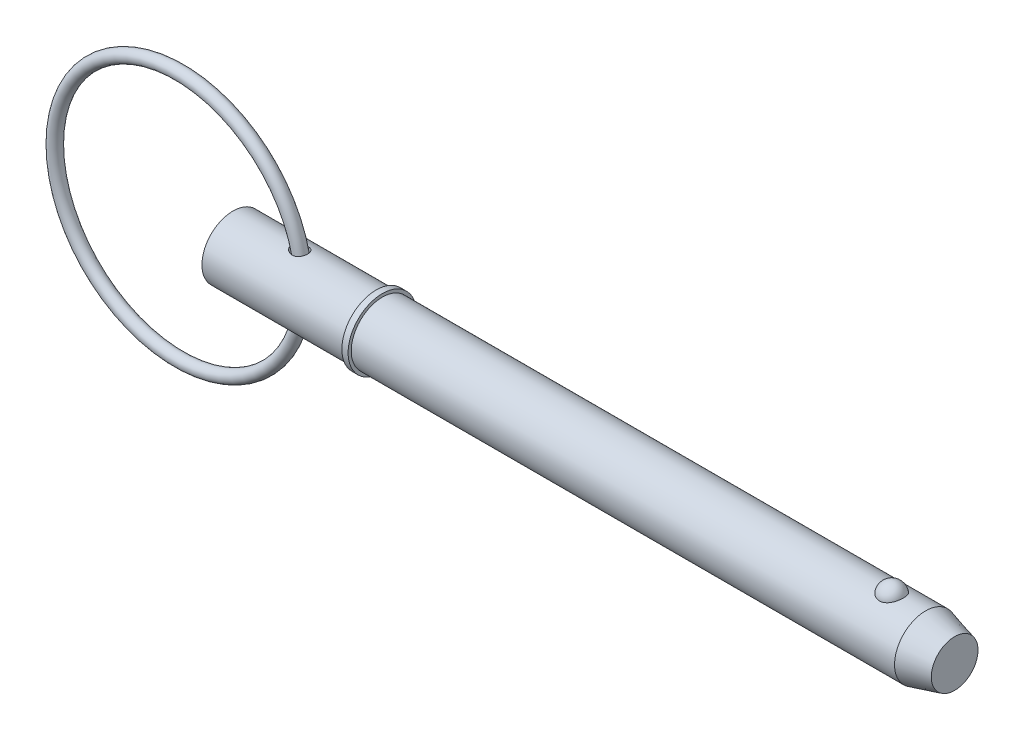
ISO-10303-21;
HEADER;
FILE_DESCRIPTION(('STEP AP214'),'2;1');
FILE_NAME('part.step','',(''),(''),'','','');
FILE_SCHEMA(('AUTOMOTIVE_DESIGN { 1 0 10303 214 1 1 1 1 }'));
ENDSEC;
DATA;
#1=APPLICATION_CONTEXT('core data for automotive mechanical design processes');
#2=APPLICATION_PROTOCOL_DEFINITION('international standard','automotive_design',2000,#1);
#3=PRODUCT_CONTEXT('',#1,'mechanical');
#4=PRODUCT('Part','Part','',(#3));
#5=PRODUCT_RELATED_PRODUCT_CATEGORY('part','',(#4));
#6=PRODUCT_DEFINITION_FORMATION('','',#4);
#7=PRODUCT_DEFINITION_CONTEXT('part definition',#1,'design');
#8=PRODUCT_DEFINITION('design','',#6,#7);
#9=PRODUCT_DEFINITION_SHAPE('','',#8);
#10=(LENGTH_UNIT() NAMED_UNIT(*) SI_UNIT(.MILLI.,.METRE.));
#11=(NAMED_UNIT(*) PLANE_ANGLE_UNIT() SI_UNIT($,.RADIAN.));
#12=(NAMED_UNIT(*) SI_UNIT($,.STERADIAN.) SOLID_ANGLE_UNIT());
#13=UNCERTAINTY_MEASURE_WITH_UNIT(LENGTH_MEASURE(1.E-05),#10,'distance_accuracy_value','');
#14=(GEOMETRIC_REPRESENTATION_CONTEXT(3) GLOBAL_UNCERTAINTY_ASSIGNED_CONTEXT((#13)) GLOBAL_UNIT_ASSIGNED_CONTEXT((#10,
#11,#12)) REPRESENTATION_CONTEXT('',''));
#15=CARTESIAN_POINT('',(0.,0.,0.));
#16=DIRECTION('',(0.,0.,1.));
#17=DIRECTION('',(1.,0.,0.));
#18=AXIS2_PLACEMENT_3D('',#15,#16,#17);
#19=CARTESIAN_POINT('',(-6.86864682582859,0.,0.));
#20=DIRECTION('',(0.,0.,1.));
#21=DIRECTION('',(1.,0.,0.));
#22=AXIS2_PLACEMENT_3D('',#19,#20,#21);
#23=TOROIDAL_SURFACE('',#22,15.875,0.794);
#24=CARTESIAN_POINT('',(9.80035317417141,0.,0.));
#25=VERTEX_POINT('',#24);
#26=VERTEX_LOOP('',#25);
#27=FACE_BOUND('',#26,.T.);
#28=ADVANCED_FACE('P0_F12',(#27),#23,.T.);
#29=CLOSED_SHELL('',(#28));
#30=MANIFOLD_SOLID_BREP('P0_B1',#29);
#31=CARTESIAN_POINT('',(0.,0.,0.));
#32=DIRECTION('',(1.,0.,0.));
#33=DIRECTION('',(0.,0.,-1.));
#34=AXIS2_PLACEMENT_3D('',#31,#32,#33);
#35=CYLINDRICAL_SURFACE('',#34,3.97);
#36=CARTESIAN_POINT('',(7.49679817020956,3.96502331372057,-0.198721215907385));
#37=CARTESIAN_POINT('',(7.50881508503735,3.96235594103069,-0.251916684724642));
#38=CARTESIAN_POINT('',(7.52561550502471,3.95866151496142,-0.304017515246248));
#39=CARTESIAN_POINT('',(7.56786984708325,3.9496659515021,-0.40447153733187));
#40=CARTESIAN_POINT('',(7.59333797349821,3.94436217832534,-0.452818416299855));
#41=CARTESIAN_POINT('',(7.65162192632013,3.93277091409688,-0.544364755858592));
#42=CARTESIAN_POINT('',(7.68440149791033,3.92648832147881,-0.587588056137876));
#43=CARTESIAN_POINT('',(7.75622109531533,3.91354812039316,-0.668369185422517));
#44=CARTESIAN_POINT('',(7.79526077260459,3.90689053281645,-0.705927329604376));
#45=CARTESIAN_POINT('',(7.88192852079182,3.8932854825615,-0.777603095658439));
#46=CARTESIAN_POINT('',(7.92999678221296,3.88635845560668,-0.811192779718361));
#47=CARTESIAN_POINT('',(8.03094744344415,3.87352417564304,-0.870420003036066));
#48=CARTESIAN_POINT('',(8.08383192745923,3.86761736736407,-0.896054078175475));
#49=CARTESIAN_POINT('',(8.19632733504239,3.85719062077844,-0.939958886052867));
#50=CARTESIAN_POINT('',(8.25615064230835,3.85277154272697,-0.957713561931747));
#51=CARTESIAN_POINT('',(8.37807849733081,3.84644428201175,-0.982821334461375));
#52=CARTESIAN_POINT('',(8.44018249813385,3.84453550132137,-0.990176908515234));
#53=CARTESIAN_POINT('',(8.56256649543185,3.84359535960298,-0.993820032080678));
#54=CARTESIAN_POINT('',(8.62283390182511,3.84446524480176,-0.990487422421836));
#55=CARTESIAN_POINT('',(8.74175397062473,3.84884648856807,-0.973323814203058));
#56=CARTESIAN_POINT('',(8.8004073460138,3.85235666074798,-0.959497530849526));
#57=CARTESIAN_POINT('',(8.91034168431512,3.86130428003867,-0.922798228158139));
#58=CARTESIAN_POINT('',(8.96185380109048,3.86659969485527,-0.900580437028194));
#59=CARTESIAN_POINT('',(9.06016940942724,3.87853590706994,-0.847697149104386));
#60=CARTESIAN_POINT('',(9.10697344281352,3.88517654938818,-0.817032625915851));
#61=CARTESIAN_POINT('',(9.19340982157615,3.89885483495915,-0.748999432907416));
#62=CARTESIAN_POINT('',(9.23319345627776,3.90587821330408,-0.711819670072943));
#63=CARTESIAN_POINT('',(9.30598310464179,3.91969783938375,-0.631295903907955));
#64=CARTESIAN_POINT('',(9.33898892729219,3.92649408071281,-0.587951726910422));
#65=CARTESIAN_POINT('',(9.39769437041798,3.939185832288,-0.495874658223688));
#66=CARTESIAN_POINT('',(9.42332322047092,3.94507238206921,-0.447095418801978));
#67=CARTESIAN_POINT('',(9.46625710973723,3.9552342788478,-0.345845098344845));
#68=CARTESIAN_POINT('',(9.48356178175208,3.95950955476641,-0.293373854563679));
#69=CARTESIAN_POINT('',(9.50956700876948,3.96602451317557,-0.185698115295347));
#70=CARTESIAN_POINT('',(9.51818595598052,3.96824487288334,-0.13047272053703));
#71=CARTESIAN_POINT('',(9.52633336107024,3.97034220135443,-0.0193113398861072));
#72=CARTESIAN_POINT('',(9.52586171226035,3.97021914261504,0.0366246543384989));
#73=CARTESIAN_POINT('',(9.51583327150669,3.9676413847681,0.147685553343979));
#74=CARTESIAN_POINT('',(9.50626624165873,3.96518405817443,0.202809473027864));
#75=CARTESIAN_POINT('',(9.47825604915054,3.95819854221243,0.310618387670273));
#76=CARTESIAN_POINT('',(9.45981267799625,3.95367030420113,0.36330332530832));
#77=CARTESIAN_POINT('',(9.41448405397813,3.94303435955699,0.464739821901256));
#78=CARTESIAN_POINT('',(9.38759833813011,3.93692656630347,0.51349116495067));
#79=CARTESIAN_POINT('',(9.32603556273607,3.92380455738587,0.605663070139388));
#80=CARTESIAN_POINT('',(9.29135869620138,3.91679036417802,0.649083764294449));
#81=CARTESIAN_POINT('',(9.21526329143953,3.90267522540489,0.729160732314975));
#82=CARTESIAN_POINT('',(9.17387556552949,3.89557480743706,0.765846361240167));
#83=CARTESIAN_POINT('',(9.08536362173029,3.88206315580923,0.831635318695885));
#84=CARTESIAN_POINT('',(9.03824022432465,3.8756518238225,0.860739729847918));
#85=CARTESIAN_POINT('',(8.94022154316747,3.86431915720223,0.910262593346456));
#86=CARTESIAN_POINT('',(8.88938101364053,3.85938013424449,0.930785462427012));
#87=CARTESIAN_POINT('',(8.78488780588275,3.85141510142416,0.96321476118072));
#88=CARTESIAN_POINT('',(8.73123520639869,3.84838903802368,0.975121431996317));
#89=CARTESIAN_POINT('',(8.62249427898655,3.84453017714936,0.990226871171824));
#90=CARTESIAN_POINT('',(8.56740225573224,3.84370373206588,0.993400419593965));
#91=CARTESIAN_POINT('',(8.45741104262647,3.8442816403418,0.991160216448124));
#92=CARTESIAN_POINT('',(8.40251189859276,3.84568649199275,0.98574454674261));
#93=CARTESIAN_POINT('',(8.29176880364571,3.85062289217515,0.966285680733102));
#94=CARTESIAN_POINT('',(8.23599684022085,3.85424894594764,0.951858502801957));
#95=CARTESIAN_POINT('',(8.12747212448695,3.86325492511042,0.91461785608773));
#96=CARTESIAN_POINT('',(8.0747205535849,3.86863553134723,0.891801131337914));
#97=CARTESIAN_POINT('',(7.97015235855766,3.88095261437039,0.836633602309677));
#98=CARTESIAN_POINT('',(7.91862083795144,3.88796764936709,0.803758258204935));
#99=CARTESIAN_POINT('',(7.82179253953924,3.90250904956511,0.729888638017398));
#100=CARTESIAN_POINT('',(7.77649765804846,3.91003556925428,0.688891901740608));
#101=CARTESIAN_POINT('',(7.69332536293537,3.92478114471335,0.599225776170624));
#102=CARTESIAN_POINT('',(7.6555122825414,3.93199714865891,0.550495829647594));
#103=CARTESIAN_POINT('',(7.5894819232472,3.94512912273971,0.446741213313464));
#104=CARTESIAN_POINT('',(7.56125849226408,3.95104592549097,0.391720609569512));
#105=CARTESIAN_POINT('',(7.51806227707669,3.9603062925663,0.282172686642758));
#106=CARTESIAN_POINT('',(7.50213211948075,3.96383230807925,0.228039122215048));
#107=CARTESIAN_POINT('',(7.48057398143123,3.96863642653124,0.117706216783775));
#108=CARTESIAN_POINT('',(7.47492746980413,3.96991857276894,0.0615107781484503));
#109=CARTESIAN_POINT('',(7.47437932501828,3.97004395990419,-0.0289758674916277));
#110=CARTESIAN_POINT('',(7.47615129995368,3.96964216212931,-0.0632805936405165));
#111=CARTESIAN_POINT('',(7.48358566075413,3.96796978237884,-0.131441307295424));
#112=CARTESIAN_POINT('',(7.48924767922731,3.96669928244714,-0.165297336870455));
#113=CARTESIAN_POINT('',(7.49679817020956,3.96502331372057,-0.198721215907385));
#114=B_SPLINE_CURVE_WITH_KNOTS('',3,(#36,#37,#38,#39,#40,#41,#42,#43,#44,#45,#46,#47,#48,#49,
#50,#51,#52,#53,#54,#55,#56,#57,#58,#59,#60,#61,#62,#63,#64,#65,#66,#67,#68,#69,#70,#71,#72,#73,
#74,#75,#76,#77,#78,#79,#80,#81,#82,#83,#84,#85,#86,#87,#88,#89,#90,#91,#92,#93,#94,#95,#96,#97,
#98,#99,#100,#101,#102,#103,#104,#105,#106,#107,#108,#109,#110,#111,#112,#113),.UNSPECIFIED.,
.T.,.F.,(4,2,2,2,2,2,2,2,2,2,2,2,2,2,2,2,2,2,2,2,2,2,2,2,2,2,2,2,2,2,2,2,2,2,2,2,2,2,4),(0.,
0.163661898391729,0.327593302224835,0.490729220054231,0.653856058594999,0.830244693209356,
1.00671002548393,1.1934572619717,1.38016000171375,1.56030212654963,1.74036335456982,
1.90857505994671,2.07676738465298,2.24071128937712,2.40465981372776,2.57013239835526,
2.73561228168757,2.90263284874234,3.06965537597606,3.23686612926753,3.40408081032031,
3.5713046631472,3.73852437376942,3.90499698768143,4.07144581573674,4.2358058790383,
4.40016134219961,4.56499094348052,4.72985735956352,4.90227873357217,5.0747670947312,
5.25849939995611,5.44228744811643,5.62759301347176,5.81277947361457,5.98144776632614,
6.14981181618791,6.25265388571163,6.35548624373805),.UNSPECIFIED.);
#115=CARTESIAN_POINT('',(7.49679817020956,3.96502331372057,-0.198721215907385));
#116=VERTEX_POINT('',#115);
#117=EDGE_CURVE('P1_E42',#116,#116,#114,.T.);
#118=ORIENTED_EDGE('',*,*,#117,.T.);
#119=EDGE_LOOP('',(#118));
#120=FACE_BOUND('',#119,.T.);
#121=CARTESIAN_POINT('',(0.,0.,0.));
#122=DIRECTION('',(1.,0.,0.));
#123=DIRECTION('',(0.,0.,-1.));
#124=AXIS2_PLACEMENT_3D('',#121,#122,#123);
#125=CIRCLE('',#124,3.97);
#126=CARTESIAN_POINT('',(0.,0.,-3.97));
#127=VERTEX_POINT('',#126);
#128=EDGE_CURVE('P1_E9',#127,#127,#125,.T.);
#129=ORIENTED_EDGE('',*,*,#128,.T.);
#130=EDGE_LOOP('',(#129));
#131=FACE_BOUND('',#130,.T.);
#132=CARTESIAN_POINT('',(18.256,0.,0.));
#133=DIRECTION('',(1.,0.,0.));
#134=DIRECTION('',(0.,0.,-1.));
#135=AXIS2_PLACEMENT_3D('',#132,#133,#134);
#136=CIRCLE('',#135,3.97);
#137=CARTESIAN_POINT('',(18.256,0.,-3.97));
#138=VERTEX_POINT('',#137);
#139=EDGE_CURVE('P1_E25',#138,#138,#136,.T.);
#140=ORIENTED_EDGE('',*,*,#139,.F.);
#141=EDGE_LOOP('',(#140));
#142=FACE_BOUND('',#141,.T.);
#143=CARTESIAN_POINT('',(7.49679817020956,-3.96502331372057,-0.198721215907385));
#144=CARTESIAN_POINT('',(7.48580986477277,-3.96746179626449,-0.150065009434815));
#145=CARTESIAN_POINT('',(7.47881617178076,-3.96904213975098,-0.100459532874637));
#146=CARTESIAN_POINT('',(7.47318383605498,-3.97031279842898,-0.000748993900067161));
#147=CARTESIAN_POINT('',(7.47454464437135,-3.97000323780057,0.049356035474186));
#148=CARTESIAN_POINT('',(7.48554252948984,-3.9675299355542,0.148550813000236));
#149=CARTESIAN_POINT('',(7.49517270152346,-3.9653677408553,0.197641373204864));
#150=CARTESIAN_POINT('',(7.5222068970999,-3.95942609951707,0.293523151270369));
#151=CARTESIAN_POINT('',(7.53961293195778,-3.9556462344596,0.340313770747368));
#152=CARTESIAN_POINT('',(7.58186218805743,-3.946757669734,0.431446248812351));
#153=CARTESIAN_POINT('',(7.6068526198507,-3.94162295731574,0.475716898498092));
#154=CARTESIAN_POINT('',(7.66318857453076,-3.93055115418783,0.559886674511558));
#155=CARTESIAN_POINT('',(7.69453617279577,-3.92461380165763,0.599784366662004));
#156=CARTESIAN_POINT('',(7.76618955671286,-3.91181958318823,0.678467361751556));
#157=CARTESIAN_POINT('',(7.80708710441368,-3.90493119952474,0.716708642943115));
#158=CARTESIAN_POINT('',(7.89431870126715,-3.89148185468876,0.786469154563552));
#159=CARTESIAN_POINT('',(7.94065563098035,-3.88492106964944,0.817984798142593));
#160=CARTESIAN_POINT('',(8.04208221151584,-3.87221514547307,0.876253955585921));
#161=CARTESIAN_POINT('',(8.09758465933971,-3.8661622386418,0.902312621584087));
#162=CARTESIAN_POINT('',(8.21228401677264,-3.855952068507,0.944996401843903));
#163=CARTESIAN_POINT('',(8.27148128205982,-3.85179498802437,0.961620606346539));
#164=CARTESIAN_POINT('',(8.39228716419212,-3.84593851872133,0.984786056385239));
#165=CARTESIAN_POINT('',(8.45390693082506,-3.84425231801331,0.991273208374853));
#166=CARTESIAN_POINT('',(8.57734686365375,-3.84370168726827,0.993408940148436));
#167=CARTESIAN_POINT('',(8.63916691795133,-3.84483588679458,0.989062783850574));
#168=CARTESIAN_POINT('',(8.75703619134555,-3.84970227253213,0.969937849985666));
#169=CARTESIAN_POINT('',(8.81320274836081,-3.85326512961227,0.955838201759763));
#170=CARTESIAN_POINT('',(8.92207486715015,-3.8624204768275,0.918140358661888));
#171=CARTESIAN_POINT('',(8.97478130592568,-3.86801245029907,0.89454458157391));
#172=CARTESIAN_POINT('',(9.07264210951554,-3.88024902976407,0.83982747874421));
#173=CARTESIAN_POINT('',(9.11803751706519,-3.88683023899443,0.809121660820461));
#174=CARTESIAN_POINT('',(9.20292513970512,-3.90048324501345,0.740506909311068));
#175=CARTESIAN_POINT('',(9.24241747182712,-3.90755503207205,0.702598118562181));
#176=CARTESIAN_POINT('',(9.31440361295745,-3.92139192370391,0.620727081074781));
#177=CARTESIAN_POINT('',(9.34691105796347,-3.9281576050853,0.576776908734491));
#178=CARTESIAN_POINT('',(9.40424150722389,-3.94066521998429,0.483990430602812));
#179=CARTESIAN_POINT('',(9.4290641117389,-3.94640710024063,0.435153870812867));
#180=CARTESIAN_POINT('',(9.47070060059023,-3.95631713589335,0.333318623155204));
#181=CARTESIAN_POINT('',(9.48741220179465,-3.96046506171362,0.280276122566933));
#182=CARTESIAN_POINT('',(9.51197570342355,-3.9666399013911,0.172058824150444));
#183=CARTESIAN_POINT('',(9.5198274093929,-3.96866676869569,0.116883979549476));
#184=CARTESIAN_POINT('',(9.52650209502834,-3.9703865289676,0.00572427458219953));
#185=CARTESIAN_POINT('',(9.52528754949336,-3.97006972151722,-0.0502629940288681));
#186=CARTESIAN_POINT('',(9.51376883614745,-3.96711300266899,-0.161232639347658));
#187=CARTESIAN_POINT('',(9.50346452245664,-3.96447305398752,-0.216214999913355));
#188=CARTESIAN_POINT('',(9.47400716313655,-3.95715440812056,-0.323616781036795));
#189=CARTESIAN_POINT('',(9.45485370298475,-3.95247561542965,-0.376036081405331));
#190=CARTESIAN_POINT('',(9.40815019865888,-3.94158766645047,-0.47682082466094));
#191=CARTESIAN_POINT('',(9.38060003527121,-3.93537848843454,-0.525186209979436));
#192=CARTESIAN_POINT('',(9.31780916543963,-3.92212278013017,-0.616423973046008));
#193=CARTESIAN_POINT('',(9.28257772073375,-3.91507726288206,-0.659302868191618));
#194=CARTESIAN_POINT('',(9.20530256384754,-3.90093459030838,-0.738394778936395));
#195=CARTESIAN_POINT('',(9.16325952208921,-3.8938374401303,-0.774608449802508));
#196=CARTESIAN_POINT('',(9.07394283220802,-3.88046830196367,-0.83901178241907));
#197=CARTESIAN_POINT('',(9.02672460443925,-3.87418889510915,-0.867276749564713));
#198=CARTESIAN_POINT('',(8.92806876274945,-3.86308015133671,-0.915492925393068));
#199=CARTESIAN_POINT('',(8.87663164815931,-3.85825064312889,-0.935445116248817));
#200=CARTESIAN_POINT('',(8.77150354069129,-3.85059630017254,-0.966469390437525));
#201=CARTESIAN_POINT('',(8.71783614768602,-3.84775433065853,-0.977617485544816));
#202=CARTESIAN_POINT('',(8.60934883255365,-3.84426767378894,-0.991239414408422));
#203=CARTESIAN_POINT('',(8.55452877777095,-3.84362324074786,-0.993712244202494));
#204=CARTESIAN_POINT('',(8.4438244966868,-3.84454392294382,-0.990144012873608));
#205=CARTESIAN_POINT('',(8.3879479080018,-3.84616465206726,-0.983888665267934));
#206=CARTESIAN_POINT('',(8.27791058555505,-3.85146784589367,-0.962917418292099));
#207=CARTESIAN_POINT('',(8.22375037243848,-3.85515092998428,-0.948198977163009));
#208=CARTESIAN_POINT('',(8.11503410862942,-3.86443542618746,-0.90964598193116));
#209=CARTESIAN_POINT('',(8.06067129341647,-3.87014379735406,-0.885291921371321));
#210=CARTESIAN_POINT('',(7.95661263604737,-3.88274545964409,-0.828274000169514));
#211=CARTESIAN_POINT('',(7.90691941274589,-3.88963940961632,-0.795605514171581));
#212=CARTESIAN_POINT('',(7.81143608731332,-3.90417480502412,-0.720990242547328));
#213=CARTESIAN_POINT('',(7.76592225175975,-3.9118359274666,-0.678692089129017));
#214=CARTESIAN_POINT('',(7.68309200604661,-3.926691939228,-0.586646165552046));
#215=CARTESIAN_POINT('',(7.6457689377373,-3.93388720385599,-0.536904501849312));
#216=CARTESIAN_POINT('',(7.58649683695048,-3.94577687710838,-0.440118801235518));
#217=CARTESIAN_POINT('',(7.56301593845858,-3.95068841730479,-0.394037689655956));
#218=CARTESIAN_POINT('',(7.52386335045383,-3.95904753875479,-0.298549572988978));
#219=CARTESIAN_POINT('',(7.5081856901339,-3.96249623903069,-0.249145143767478));
#220=CARTESIAN_POINT('',(7.49679817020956,-3.96502331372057,-0.198721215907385));
#221=B_SPLINE_CURVE_WITH_KNOTS('',3,(#143,#144,#145,#146,#147,#148,#149,#150,#151,#152,#153,
#154,#155,#156,#157,#158,#159,#160,#161,#162,#163,#164,#165,#166,#167,#168,#169,#170,#171,#172,
#173,#174,#175,#176,#177,#178,#179,#180,#181,#182,#183,#184,#185,#186,#187,#188,#189,#190,#191,
#192,#193,#194,#195,#196,#197,#198,#199,#200,#201,#202,#203,#204,#205,#206,#207,#208,#209,#210,
#211,#212,#213,#214,#215,#216,#217,#218,#219,#220),.UNSPECIFIED.,.T.,.F.,(4,2,2,2,2,2,2,2,2,2,2,
2,2,2,2,2,2,2,2,2,2,2,2,2,2,2,2,2,2,2,2,2,2,2,2,2,2,2,4),(0.,0.149644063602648,
0.299278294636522,0.448787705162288,0.598335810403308,0.750995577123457,0.903705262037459,
1.07224475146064,1.2408739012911,1.4248565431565,1.60885692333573,1.79383585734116,
1.97872492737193,2.15188813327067,2.32500727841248,2.489818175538,2.65462580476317,
2.81910871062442,2.98360017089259,3.15011526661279,3.31663401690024,3.48384236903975,
3.65105340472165,3.81827227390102,3.98549351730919,4.15251423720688,4.31951852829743,
4.48488279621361,4.65022752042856,4.81412860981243,4.97804866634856,5.14606470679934,
5.31413123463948,5.49286956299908,5.67170754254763,5.85859317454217,6.0453263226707,
6.20052601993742,6.35560677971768),.UNSPECIFIED.);
#222=CARTESIAN_POINT('',(7.49679817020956,-3.96502331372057,-0.198721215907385));
#223=VERTEX_POINT('',#222);
#224=EDGE_CURVE('P1_E17',#223,#223,#221,.T.);
#225=ORIENTED_EDGE('',*,*,#224,.T.);
#226=EDGE_LOOP('',(#225));
#227=FACE_BOUND('',#226,.T.);
#228=ADVANCED_FACE('P1_F13',(#120,#131,#142,#227),#35,.T.);
#229=CARTESIAN_POINT('',(0.,0.,0.));
#230=DIRECTION('',(1.,0.,0.));
#231=DIRECTION('',(0.,0.,-1.));
#232=AXIS2_PLACEMENT_3D('',#229,#230,#231);
#233=CYLINDRICAL_SURFACE('',#232,3.97);
#234=CARTESIAN_POINT('',(88.3759395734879,0.,0.));
#235=DIRECTION('',(1.,0.,0.));
#236=DIRECTION('',(0.,0.,-1.));
#237=AXIS2_PLACEMENT_3D('',#234,#235,#236);
#238=CIRCLE('',#237,3.97);
#239=CARTESIAN_POINT('',(88.3759395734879,0.,-3.97));
#240=VERTEX_POINT('',#239);
#241=EDGE_CURVE('P1_E99',#240,#240,#238,.T.);
#242=ORIENTED_EDGE('',*,*,#241,.F.);
#243=EDGE_LOOP('',(#242));
#244=FACE_BOUND('',#243,.T.);
#245=CARTESIAN_POINT('',(19.05,0.,0.));
#246=DIRECTION('',(1.,0.,0.));
#247=DIRECTION('',(0.,0.,-1.));
#248=AXIS2_PLACEMENT_3D('',#245,#246,#247);
#249=CIRCLE('',#248,3.97);
#250=CARTESIAN_POINT('',(19.05,0.,-3.97));
#251=VERTEX_POINT('',#250);
#252=EDGE_CURVE('P1_E96',#251,#251,#249,.T.);
#253=ORIENTED_EDGE('',*,*,#252,.T.);
#254=EDGE_LOOP('',(#253));
#255=FACE_BOUND('',#254,.T.);
#256=CARTESIAN_POINT('',(84.0451922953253,3.65715365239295,1.5447094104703));
#257=CARTESIAN_POINT('',(83.9652448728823,3.65716001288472,1.54470290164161));
#258=CARTESIAN_POINT('',(83.8851650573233,3.65987074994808,1.53832549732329));
#259=CARTESIAN_POINT('',(83.7272374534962,3.6704221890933,1.51297018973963));
#260=CARTESIAN_POINT('',(83.6493961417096,3.67827646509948,1.49395894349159));
#261=CARTESIAN_POINT('',(83.4984614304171,3.69818848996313,1.4439595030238));
#262=CARTESIAN_POINT('',(83.4253560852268,3.71023513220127,1.41300293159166));
#263=CARTESIAN_POINT('',(83.2855630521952,3.7372183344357,1.34000212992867));
#264=CARTESIAN_POINT('',(83.2188725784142,3.75215363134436,1.29796274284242));
#265=CARTESIAN_POINT('',(83.09148864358,3.78384968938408,1.20248834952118));
#266=CARTESIAN_POINT('',(83.0310299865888,3.80065129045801,1.14875388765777));
#267=CARTESIAN_POINT('',(82.9196942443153,3.83398532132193,1.03205417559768));
#268=CARTESIAN_POINT('',(82.8688200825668,3.85051766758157,0.969086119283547));
#269=CARTESIAN_POINT('',(82.7756321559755,3.88238608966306,0.832526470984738));
#270=CARTESIAN_POINT('',(82.7337961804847,3.89763698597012,0.758588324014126));
#271=CARTESIAN_POINT('',(82.6625108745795,3.92451063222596,0.604352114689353));
#272=CARTESIAN_POINT('',(82.6330623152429,3.93613315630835,0.524053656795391));
#273=CARTESIAN_POINT('',(82.5868927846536,3.95467606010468,0.358403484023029));
#274=CARTESIAN_POINT('',(82.5703127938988,3.96154426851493,0.273006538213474));
#275=CARTESIAN_POINT('',(82.550756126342,3.96967008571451,0.10040860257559));
#276=CARTESIAN_POINT('',(82.5477789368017,3.97092790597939,0.0132076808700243));
#277=CARTESIAN_POINT('',(82.5554587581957,3.96771794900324,-0.159844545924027));
#278=CARTESIAN_POINT('',(82.5660164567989,3.96329187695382,-0.245701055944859));
#279=CARTESIAN_POINT('',(82.6003800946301,3.94923163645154,-0.414277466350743));
#280=CARTESIAN_POINT('',(82.6241862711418,3.93959737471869,-0.496997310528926));
#281=CARTESIAN_POINT('',(82.6846114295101,3.91607752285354,-0.657113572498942));
#282=CARTESIAN_POINT('',(82.7212495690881,3.90218558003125,-0.73450182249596));
#283=CARTESIAN_POINT('',(82.8065935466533,3.87158287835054,-0.881704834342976));
#284=CARTESIAN_POINT('',(82.8553004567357,3.8548718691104,-0.951518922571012));
#285=CARTESIAN_POINT('',(82.9641161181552,3.82028735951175,-1.08208159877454));
#286=CARTESIAN_POINT('',(83.0242955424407,3.80240713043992,-1.14276958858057));
#287=CARTESIAN_POINT('',(83.154493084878,3.76758161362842,-1.2528243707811));
#288=CARTESIAN_POINT('',(83.2245105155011,3.75063626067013,-1.30219195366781));
#289=CARTESIAN_POINT('',(83.37118160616,3.71998948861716,-1.38729709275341));
#290=CARTESIAN_POINT('',(83.4476813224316,3.70623183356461,-1.42327904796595));
#291=CARTESIAN_POINT('',(83.6062981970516,3.68323188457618,-1.48178996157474));
#292=CARTESIAN_POINT('',(83.6884132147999,3.67398788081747,-1.50432401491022));
#293=CARTESIAN_POINT('',(83.8514810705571,3.6615216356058,-1.53440939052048));
#294=CARTESIAN_POINT('',(83.9322840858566,3.65801951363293,-1.54265826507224));
#295=CARTESIAN_POINT('',(84.0942085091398,3.65657341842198,-1.54608423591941));
#296=CARTESIAN_POINT('',(84.1753298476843,3.65862829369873,-1.5412640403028));
#297=CARTESIAN_POINT('',(84.3328122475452,3.66788969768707,-1.51908474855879));
#298=CARTESIAN_POINT('',(84.4092422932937,3.67492621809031,-1.50213925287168));
#299=CARTESIAN_POINT('',(84.5580412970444,3.69318404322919,-1.4566698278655));
#300=CARTESIAN_POINT('',(84.6304099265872,3.7044056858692,-1.42814496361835));
#301=CARTESIAN_POINT('',(84.7708029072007,3.73012749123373,-1.35956319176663));
#302=CARTESIAN_POINT('',(84.8387000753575,3.74469307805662,-1.31927107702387));
#303=CARTESIAN_POINT('',(84.9668649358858,3.77545272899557,-1.22847440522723));
#304=CARTESIAN_POINT('',(85.0271308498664,3.79164717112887,-1.17796747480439));
#305=CARTESIAN_POINT('',(85.1416346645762,3.82490325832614,-1.0651926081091));
#306=CARTESIAN_POINT('',(85.1954137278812,3.84196735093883,-1.0024591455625));
#307=CARTESIAN_POINT('',(85.2920988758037,3.87439863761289,-0.868715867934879));
#308=CARTESIAN_POINT('',(85.3350030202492,3.88976552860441,-0.797704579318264));
#309=CARTESIAN_POINT('',(85.410266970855,3.91771381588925,-0.646896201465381));
#310=CARTESIAN_POINT('',(85.4422532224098,3.93019255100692,-0.566893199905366));
#311=CARTESIAN_POINT('',(85.4931101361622,3.95043886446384,-0.402255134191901));
#312=CARTESIAN_POINT('',(85.5119807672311,3.95820643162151,-0.317620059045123));
#313=CARTESIAN_POINT('',(85.5362162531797,3.96823733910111,-0.146156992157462));
#314=CARTESIAN_POINT('',(85.5415874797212,3.97050327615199,-0.0593300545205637));
#315=CARTESIAN_POINT('',(85.5387309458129,3.96930811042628,0.114057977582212));
#316=CARTESIAN_POINT('',(85.5305035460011,3.9658471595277,0.200619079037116));
#317=CARTESIAN_POINT('',(85.5007063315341,3.95358562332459,0.37050665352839));
#318=CARTESIAN_POINT('',(85.4792129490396,3.94481563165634,0.453848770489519));
#319=CARTESIAN_POINT('',(85.4233839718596,3.92284586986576,0.615497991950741));
#320=CARTESIAN_POINT('',(85.3890474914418,3.90964579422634,0.693804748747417));
#321=CARTESIAN_POINT('',(85.3079702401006,3.88006987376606,0.843703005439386));
#322=CARTESIAN_POINT('',(85.2611536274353,3.86367478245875,0.915249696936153));
#323=CARTESIAN_POINT('',(85.1561897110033,3.82949741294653,1.04910810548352));
#324=CARTESIAN_POINT('',(85.0980428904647,3.81171519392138,1.1114202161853));
#325=CARTESIAN_POINT('',(84.9717433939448,3.77673366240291,1.22503948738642));
#326=CARTESIAN_POINT('',(84.9035970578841,3.75953398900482,1.27635357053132));
#327=CARTESIAN_POINT('',(84.7589009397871,3.72770506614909,1.36653336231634));
#328=CARTESIAN_POINT('',(84.682348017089,3.7130767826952,1.40539439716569));
#329=CARTESIAN_POINT('',(84.5257594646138,3.68864287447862,1.46830480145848));
#330=CARTESIAN_POINT('',(84.4459307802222,3.67869017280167,1.49281289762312));
#331=CARTESIAN_POINT('',(84.2829877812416,3.66414535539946,1.52817474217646));
#332=CARTESIAN_POINT('',(84.1998840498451,3.65953723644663,1.53906926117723));
#333=CARTESIAN_POINT('',(84.0927760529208,3.6573894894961,1.54414878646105));
#334=CARTESIAN_POINT('',(84.0689900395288,3.65715175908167,1.54471134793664));
#335=CARTESIAN_POINT('',(84.0451922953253,3.65715365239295,1.5447094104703));
#336=B_SPLINE_CURVE_WITH_KNOTS('',3,(#256,#257,#258,#259,#260,#261,#262,#263,#264,#265,#266,
#267,#268,#269,#270,#271,#272,#273,#274,#275,#276,#277,#278,#279,#280,#281,#282,#283,#284,#285,
#286,#287,#288,#289,#290,#291,#292,#293,#294,#295,#296,#297,#298,#299,#300,#301,#302,#303,#304,
#305,#306,#307,#308,#309,#310,#311,#312,#313,#314,#315,#316,#317,#318,#319,#320,#321,#322,#323,
#324,#325,#326,#327,#328,#329,#330,#331,#332,#333,#334,#335),.UNSPECIFIED.,.T.,.F.,(4,2,2,2,2,2,
2,2,2,2,2,2,2,2,2,2,2,2,2,2,2,2,2,2,2,2,2,2,2,2,2,2,2,2,2,2,2,2,2,4),(0.,0.239777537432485,
0.480190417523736,0.719971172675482,0.9596473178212,1.20639040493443,1.45320863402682,
1.71093679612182,1.9686809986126,2.22921052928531,2.48973023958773,2.74834928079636,
3.00697295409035,3.26598440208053,3.52501886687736,3.78570385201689,4.04637062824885,
4.30201257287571,4.55755760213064,4.80022994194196,5.04285200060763,5.27757006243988,
5.51230707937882,5.75210128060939,5.99195126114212,6.2439281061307,6.49594987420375,
6.75588818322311,7.01582710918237,7.27564332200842,7.53545264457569,7.79377886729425,
8.05212290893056,8.31207418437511,8.57201437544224,8.83179046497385,9.09166393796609,
9.34270057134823,9.59298357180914,9.66435753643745),.UNSPECIFIED.);
#337=CARTESIAN_POINT('',(84.0451922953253,3.65715365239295,1.5447094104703));
#338=VERTEX_POINT('',#337);
#339=EDGE_CURVE('P1_E34',#338,#338,#336,.T.);
#340=ORIENTED_EDGE('',*,*,#339,.T.);
#341=EDGE_LOOP('',(#340));
#342=FACE_BOUND('',#341,.T.);
#343=ADVANCED_FACE('P1_F46',(#244,#255,#342),#233,.T.);
#344=CARTESIAN_POINT('',(0.,0.,0.));
#345=DIRECTION('',(-1.,0.,0.));
#346=DIRECTION('',(0.,0.,1.));
#347=AXIS2_PLACEMENT_3D('',#344,#345,#346);
#348=PLANE('',#347);
#349=ORIENTED_EDGE('',*,*,#128,.F.);
#350=EDGE_LOOP('',(#349));
#351=FACE_BOUND('',#350,.T.);
#352=ADVANCED_FACE('P1_F15',(#351),#348,.T.);
#353=CARTESIAN_POINT('',(18.256,3.97,0.));
#354=DIRECTION('',(-1.,0.,0.));
#355=DIRECTION('',(0.,0.,1.));
#356=AXIS2_PLACEMENT_3D('',#353,#354,#355);
#357=PLANE('',#356);
#358=ORIENTED_EDGE('',*,*,#139,.T.);
#359=EDGE_LOOP('',(#358));
#360=FACE_BOUND('',#359,.T.);
#361=CARTESIAN_POINT('',(18.256,0.,0.));
#362=DIRECTION('',(1.,0.,0.));
#363=DIRECTION('',(0.,0.,-1.));
#364=AXIS2_PLACEMENT_3D('',#361,#362,#363);
#365=CIRCLE('',#364,4.367);
#366=CARTESIAN_POINT('',(18.256,0.,-4.367));
#367=VERTEX_POINT('',#366);
#368=EDGE_CURVE('P1_E30',#367,#367,#365,.T.);
#369=ORIENTED_EDGE('',*,*,#368,.F.);
#370=EDGE_LOOP('',(#369));
#371=FACE_BOUND('',#370,.T.);
#372=ADVANCED_FACE('P1_F81',(#360,#371),#357,.T.);
#373=CARTESIAN_POINT('',(0.,0.,0.));
#374=DIRECTION('',(1.,0.,0.));
#375=DIRECTION('',(0.,0.,-1.));
#376=AXIS2_PLACEMENT_3D('',#373,#374,#375);
#377=CYLINDRICAL_SURFACE('',#376,4.367);
#378=ORIENTED_EDGE('',*,*,#368,.T.);
#379=EDGE_LOOP('',(#378));
#380=FACE_BOUND('',#379,.T.);
#381=CARTESIAN_POINT('',(19.05,0.,0.));
#382=DIRECTION('',(1.,0.,0.));
#383=DIRECTION('',(0.,0.,-1.));
#384=AXIS2_PLACEMENT_3D('',#381,#382,#383);
#385=CIRCLE('',#384,4.367);
#386=CARTESIAN_POINT('',(19.05,0.,-4.367));
#387=VERTEX_POINT('',#386);
#388=EDGE_CURVE('P1_E95',#387,#387,#385,.T.);
#389=ORIENTED_EDGE('',*,*,#388,.F.);
#390=EDGE_LOOP('',(#389));
#391=FACE_BOUND('',#390,.T.);
#392=ADVANCED_FACE('P1_F68',(#380,#391),#377,.T.);
#393=CARTESIAN_POINT('',(19.05,4.367,0.));
#394=DIRECTION('',(1.,0.,0.));
#395=DIRECTION('',(0.,0.,-1.));
#396=AXIS2_PLACEMENT_3D('',#393,#394,#395);
#397=PLANE('',#396);
#398=ORIENTED_EDGE('',*,*,#388,.T.);
#399=EDGE_LOOP('',(#398));
#400=FACE_BOUND('',#399,.T.);
#401=ORIENTED_EDGE('',*,*,#252,.F.);
#402=EDGE_LOOP('',(#401));
#403=FACE_BOUND('',#402,.T.);
#404=ADVANCED_FACE('P1_F62',(#400,#403),#397,.T.);
#405=CARTESIAN_POINT('',(92.08,0.,0.));
#406=DIRECTION('',(-1.,0.,0.));
#407=DIRECTION('',(0.,0.,1.));
#408=AXIS2_PLACEMENT_3D('',#405,#406,#407);
#409=CONICAL_SURFACE('',#408,2.97750000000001,0.26179938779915);
#410=ORIENTED_EDGE('',*,*,#241,.T.);
#411=EDGE_LOOP('',(#410));
#412=FACE_BOUND('',#411,.T.);
#413=CARTESIAN_POINT('',(92.08,0.,0.));
#414=DIRECTION('',(1.,0.,0.));
#415=DIRECTION('',(0.,0.,-1.));
#416=AXIS2_PLACEMENT_3D('',#413,#414,#415);
#417=CIRCLE('',#416,2.97750000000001);
#418=CARTESIAN_POINT('',(92.08,0.,-2.97750000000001));
#419=VERTEX_POINT('',#418);
#420=EDGE_CURVE('P1_E41',#419,#419,#417,.T.);
#421=ORIENTED_EDGE('',*,*,#420,.F.);
#422=EDGE_LOOP('',(#421));
#423=FACE_BOUND('',#422,.T.);
#424=ADVANCED_FACE('P1_F59',(#412,#423),#409,.T.);
#425=CARTESIAN_POINT('',(92.08,2.97750000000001,0.));
#426=DIRECTION('',(1.,0.,0.));
#427=DIRECTION('',(0.,0.,-1.));
#428=AXIS2_PLACEMENT_3D('',#425,#426,#427);
#429=PLANE('',#428);
#430=ORIENTED_EDGE('',*,*,#420,.T.);
#431=EDGE_LOOP('',(#430));
#432=FACE_BOUND('',#431,.T.);
#433=ADVANCED_FACE('P1_F55',(#432),#429,.T.);
#434=CARTESIAN_POINT('',(84.0451922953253,3.57299999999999,0.));
#435=DIRECTION('',(-1.,0.,0.));
#436=DIRECTION('',(0.,1.,0.));
#437=AXIS2_PLACEMENT_3D('',#434,#435,#436);
#438=SPHERICAL_SURFACE('',#437,1.54700000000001);
#439=ORIENTED_EDGE('',*,*,#339,.F.);
#440=EDGE_LOOP('',(#439));
#441=FACE_BOUND('',#440,.T.);
#442=ADVANCED_FACE('P1_F50',(#441),#438,.T.);
#443=CARTESIAN_POINT('',(-6.86864682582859,0.,0.));
#444=DIRECTION('',(0.,0.,1.));
#445=DIRECTION('',(1.,0.,0.));
#446=AXIS2_PLACEMENT_3D('',#443,#444,#445);
#447=TOROIDAL_SURFACE('',#446,15.875,0.992500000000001);
#448=ORIENTED_EDGE('',*,*,#224,.F.);
#449=EDGE_LOOP('',(#448));
#450=FACE_BOUND('',#449,.T.);
#451=ORIENTED_EDGE('',*,*,#117,.F.);
#452=EDGE_LOOP('',(#451));
#453=FACE_BOUND('',#452,.T.);
#454=ADVANCED_FACE('P1_F54',(#450,#453),#447,.F.);
#455=CLOSED_SHELL('',(#228,#343,#352,#372,#392,#404,#424,#433,#442,#454));
#456=MANIFOLD_SOLID_BREP('P1_B1',#455);
#457=ADVANCED_BREP_SHAPE_REPRESENTATION('',(#18,#30,#456),#14);
#458=SHAPE_DEFINITION_REPRESENTATION(#9,#457);
ENDSEC;
END-ISO-10303-21;
